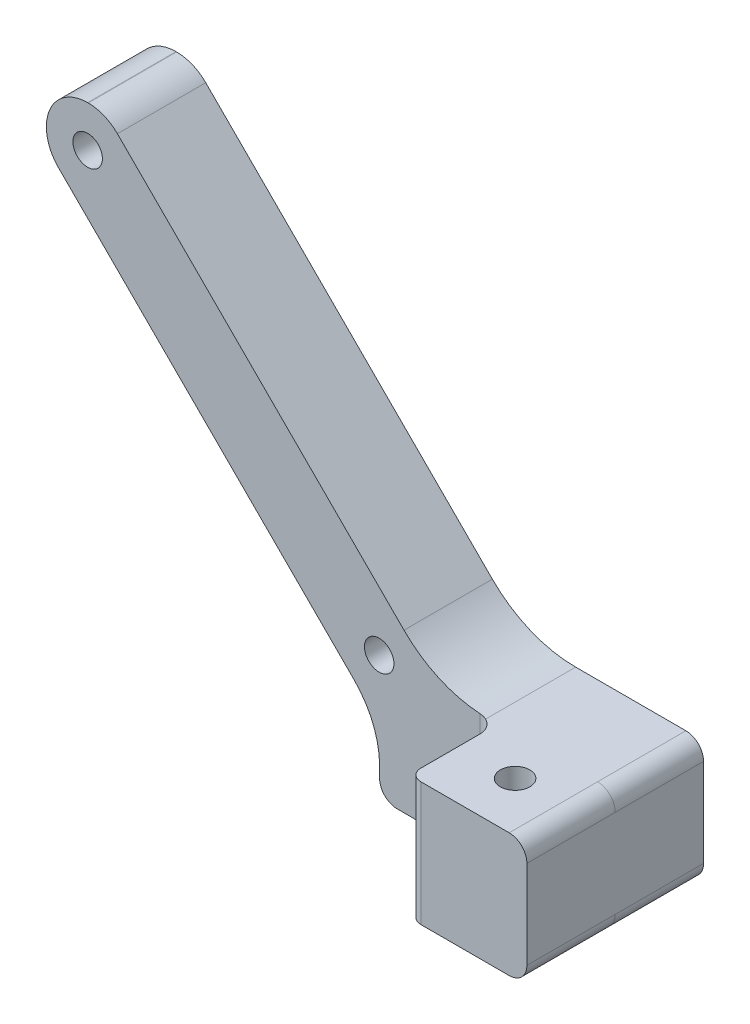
from build123d import *

# Parameters (mm, degrees)
SKETCH1_W           = 40
SKETCH1_H           = 15
BOSS_EXTRUDE1_DEPTH = 21
FILLET2_R           = 3
SKETCH2_W           = 10
SKETCH2_H           = 15
SKETCH7_W           = 15
SKETCH7_H           = 10
FILLET3_R           = 7
FILLET4_R           = 20
SKETCH8_R           = 2.5
CUT_EXTRUDE3_DEPTH  = 7.5
SKETCH9_R           = 2.5
CUT_EXTRUDE4_DEPTH  = 30.050252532
FILLET5_R           = 15
SKETCH10_W          = 20
SKETCH10_H          = 21
BOSS_EXTRUDE2_DEPTH = 15
FILLET6_R           = 3
FILLET7_R           = 3
FILLET8_R           = 2
SKETCH13_R          = 2.5
CUT_EXTRUDE5_DEPTH  = 112.291825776


with BuildPart() as part:
    # Sketch1 → Boss-Extrude1 (new body)
    with BuildSketch(Plane(origin=(0, 0, 0), x_dir=(1, 0, 0), z_dir=(0, 1, 0))):
        Rectangle(SKETCH1_W, SKETCH1_H)
    extrude(amount=BOSS_EXTRUDE1_DEPTH)

    # Fillet2
    fillet2_edges = [part.edges().sort_by_distance(p)[0] for p in [
        (20, 21, 0),
        (-20, 0, 0),
        (20, 0, 0),
    ]]
    fillet(fillet2_edges, radius=FILLET2_R)

    # Sweep1: sweep along a path in Sketch6
    with BuildLine(Plane.XY) as sweep1_path:
        Line((-20, 21), (-76.568542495, 77.568542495))
    # Sketch2 → Sweep1 (sweep)
    with BuildSketch(Plane(origin=(0, 21, 0), x_dir=(1, 0, 0), z_dir=(0, 1, 0))):
        with Locations((-15, 0)):
            Rectangle(SKETCH2_W, SKETCH2_H)
    sweep(path=sweep1_path.line)

    # Sweep2: sweep along a curve in space
    with BuildLine() as sweep2_path:
        Line((-20, 21, 7.5), (-76.568542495, 77.568542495, 7.5))
    # Sketch7 → Sweep2 (sweep)
    with BuildSketch(Plane.ZY.offset(20)):
        with Locations((0, 16)):
            Rectangle(SKETCH7_W, SKETCH7_H)
    sweep(path=sweep2_path.line)

    # Fillet3
    fillet3_edges = [part.edges().sort_by_distance(p)[0] for p in [
        (-76.568542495, 77.568542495, 0),
        (-66.568542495, 77.568542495, 0),
        (-76.568542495, 67.568542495, 0),
    ]]
    fillet(fillet3_edges, radius=FILLET3_R)

    # Fillet4
    fillet4_edges = [part.edges().sort_by_distance(p)[0] for p in [
        (-10, 21, 0),
    ]]
    fillet(fillet4_edges, radius=FILLET4_R)

    # Sketch8 → Cut-Extrude3 (cut, symmetric)
    with BuildSketch(Plane.XY):
        with Locations((-69.568542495, 70.568542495)):
            Circle(SKETCH8_R)
    extrude(amount=CUT_EXTRUDE3_DEPTH, both=True, mode=Mode.SUBTRACT)

    # Sketch9 → Cut-Extrude4 (cut, symmetric)
    with BuildSketch(Plane.XY):
        with Locations((-20.071067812, 21.071067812)):
            Circle(SKETCH9_R)
    extrude(amount=CUT_EXTRUDE4_DEPTH, both=True, mode=Mode.SUBTRACT)

    # Fillet5
    fillet5_edges = [part.edges().sort_by_distance(p)[0] for p in [
        (-20, 11, 0),
    ]]
    fillet(fillet5_edges, radius=FILLET5_R)

    # Sketch10 → Boss-Extrude2 (add)
    with BuildSketch(Plane.XY.offset(7.5)):
        with Locations((10, 10.5)):
            Rectangle(SKETCH10_W, SKETCH10_H)
    extrude(amount=BOSS_EXTRUDE2_DEPTH)

    # Fillet6
    fillet6_edges = [part.edges().sort_by_distance(p)[0] for p in [
        (20, 21, 15),
        (20, 0, 15),
    ]]
    fillet(fillet6_edges, radius=FILLET6_R)

    # Fillet7
    fillet7_edges = [part.edges().sort_by_distance(p)[0] for p in [
        (0, 10.5, 7.5),
    ]]
    fillet(fillet7_edges, radius=FILLET7_R)

    # Fillet8
    fillet8_edges = [part.edges().sort_by_distance(p)[0] for p in [
        (0, 10.5, 22.5),
    ]]
    fillet(fillet8_edges, radius=FILLET8_R)

    # Sketch13 → Cut-Extrude5 (cut, through all)
    with BuildSketch(Plane.XZ):
        with Locations(Location((9.5, 14, 0), (0, 0, 270))):
            Circle(SKETCH13_R)
    extrude(amount=-CUT_EXTRUDE5_DEPTH, mode=Mode.SUBTRACT)


solid = part.part
